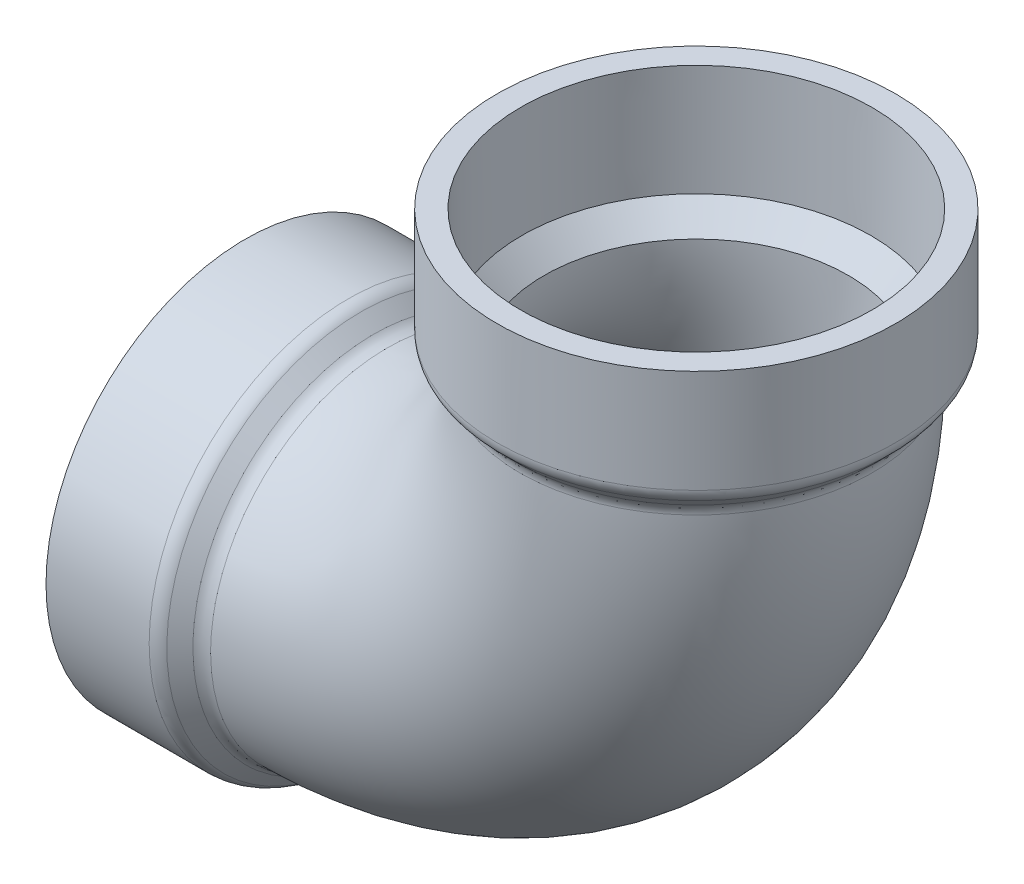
from build123d import *

# Parameters (mm, degrees)
SKETCH3_R   = 30.3149
SKETCH3_R_2 = 26.2509
FILLET1_R   = 3.048


with BuildPart() as part:
    # Sketch1 → Revolve1 (revolve)
    with BuildSketch(Plane.XY, mode=Mode.PRIVATE) as revolve1_sk:
        Polygon((-58.7375, -34.3535), (-54.6989, -30.3149), (-54.6989, -26.2509), (-58.7375, -30.099), (-77.7875, -30.2895), (-77.7875, -34.3535), align=None)
    revolve(revolve1_sk.sketch.rotate(Axis((-77.7875, 0, 0), (1, 0, 0)), 270), axis=Axis((-77.7875, 0, 0), (1, 0, 0)))



with BuildPart() as body_2:
    # Sketch2 → Revolve2 (revolve)
    with BuildSketch(Plane.XY, mode=Mode.PRIVATE) as revolve2_sk:
        Polygon((30.2895, 77.7875), (30.099, 58.7375), (26.2509, 54.6989), (30.3149, 54.6989), (34.3535, 58.7375), (34.3535, 77.7875), align=None)
    revolve(revolve2_sk.sketch.rotate(Axis((0, 0, 0), (0, 1, 0)), 90), axis=Axis((0, 0, 0), (0, 1, 0)))


with BuildPart() as part_1:
    add(part.part)

    add(body_2.part)  # Sweep1 merges body 2
    # Sweep1: sweep along a path in Sketch4
    with BuildLine(Plane.XY) as sweep1_path:
        ThreePointArc((-54.6989, 0), (-16.020936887, 16.020936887), (0, 54.6989))
    # Sketch3 → Sweep1 (sweep)
    with BuildSketch(Plane(origin=(-54.6989, 0, 0), x_dir=(0, 0, -1), z_dir=(1, 0, 0))):
        Circle(SKETCH3_R)
        Circle(SKETCH3_R_2, mode=Mode.SUBTRACT)
    sweep(path=sweep1_path.line)

    # Fillet1
    fillet1_edges = [part_1.edges().sort_by_distance(p)[0] for p in [
        (-54.6989, -30.3149, 0),
        (0, 54.6989, 30.3149),
        (0, 58.7375, 34.3535),
        (-58.7375, 0, -34.3535),
    ]]
    fillet(fillet1_edges, radius=FILLET1_R)


solid = part_1.part
